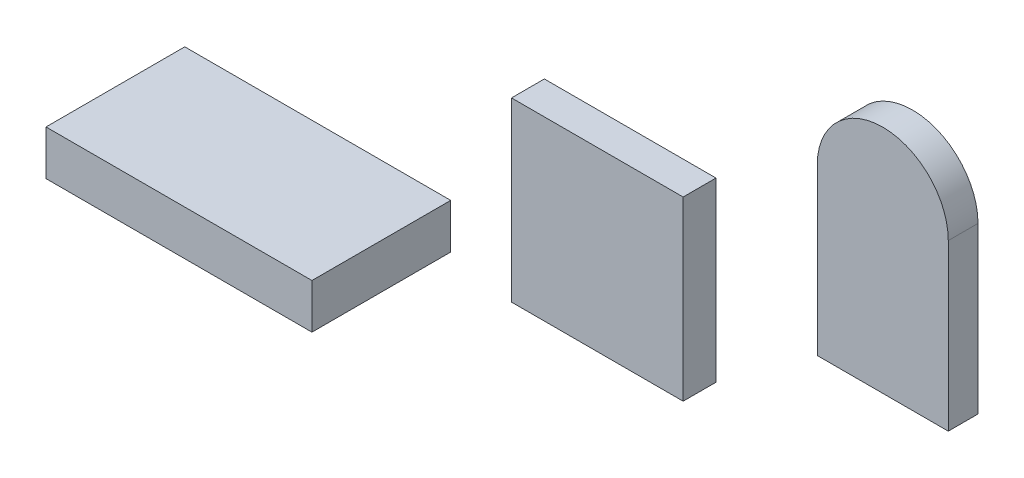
ISO-10303-21;
HEADER;
FILE_DESCRIPTION(('STEP AP214'),'2;1');
FILE_NAME('part.step','',(''),(''),'','','');
FILE_SCHEMA(('AUTOMOTIVE_DESIGN { 1 0 10303 214 1 1 1 1 }'));
ENDSEC;
DATA;
#1=APPLICATION_CONTEXT('core data for automotive mechanical design processes');
#2=APPLICATION_PROTOCOL_DEFINITION('international standard','automotive_design',2000,#1);
#3=PRODUCT_CONTEXT('',#1,'mechanical');
#4=PRODUCT('Part','Part','',(#3));
#5=PRODUCT_RELATED_PRODUCT_CATEGORY('part','',(#4));
#6=PRODUCT_DEFINITION_FORMATION('','',#4);
#7=PRODUCT_DEFINITION_CONTEXT('part definition',#1,'design');
#8=PRODUCT_DEFINITION('design','',#6,#7);
#9=PRODUCT_DEFINITION_SHAPE('','',#8);
#10=(LENGTH_UNIT() NAMED_UNIT(*) SI_UNIT(.MILLI.,.METRE.));
#11=(NAMED_UNIT(*) PLANE_ANGLE_UNIT() SI_UNIT($,.RADIAN.));
#12=(NAMED_UNIT(*) SI_UNIT($,.STERADIAN.) SOLID_ANGLE_UNIT());
#13=UNCERTAINTY_MEASURE_WITH_UNIT(LENGTH_MEASURE(1.E-05),#10,'distance_accuracy_value','');
#14=(GEOMETRIC_REPRESENTATION_CONTEXT(3) GLOBAL_UNCERTAINTY_ASSIGNED_CONTEXT((#13)) GLOBAL_UNIT_ASSIGNED_CONTEXT((#10,
#11,#12)) REPRESENTATION_CONTEXT('',''));
#15=CARTESIAN_POINT('',(0.,0.,0.));
#16=DIRECTION('',(0.,0.,1.));
#17=DIRECTION('',(1.,0.,0.));
#18=AXIS2_PLACEMENT_3D('',#15,#16,#17);
#19=CARTESIAN_POINT('',(48.4335945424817,40.2393912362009,6.63860066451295));
#20=DIRECTION('',(1.,0.,0.));
#21=DIRECTION('',(0.,0.,-1.));
#22=AXIS2_PLACEMENT_3D('',#19,#20,#21);
#23=PLANE('',#22);
#24=DIRECTION('',(0.,-1.,0.));
#25=VECTOR('',#24,1.);
#26=CARTESIAN_POINT('',(48.4335945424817,40.2393912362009,0.));
#27=LINE('',#26,#25);
#28=CARTESIAN_POINT('',(48.4335945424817,40.2393912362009,0.));
#29=VERTEX_POINT('',#28);
#30=CARTESIAN_POINT('',(48.4335945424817,3.3654763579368,0.));
#31=VERTEX_POINT('',#30);
#32=EDGE_CURVE('E106',#29,#31,#27,.T.);
#33=ORIENTED_EDGE('',*,*,#32,.T.);
#34=DIRECTION('',(0.,0.,-1.));
#35=VECTOR('',#34,1.);
#36=CARTESIAN_POINT('',(48.4335945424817,3.3654763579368,6.63860066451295));
#37=LINE('',#36,#35);
#38=CARTESIAN_POINT('',(48.4335945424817,3.3654763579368,6.63860066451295));
#39=VERTEX_POINT('',#38);
#40=EDGE_CURVE('E12',#39,#31,#37,.T.);
#41=ORIENTED_EDGE('',*,*,#40,.F.);
#42=DIRECTION('',(0.,-1.,0.));
#43=VECTOR('',#42,1.);
#44=CARTESIAN_POINT('',(48.4335945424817,40.2393912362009,6.63860066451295));
#45=LINE('',#44,#43);
#46=CARTESIAN_POINT('',(48.4335945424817,40.2393912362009,6.63860066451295));
#47=VERTEX_POINT('',#46);
#48=EDGE_CURVE('E91',#47,#39,#45,.T.);
#49=ORIENTED_EDGE('',*,*,#48,.F.);
#50=DIRECTION('',(0.,0.,-1.));
#51=VECTOR('',#50,1.);
#52=CARTESIAN_POINT('',(48.4335945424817,40.2393912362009,6.63860066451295));
#53=LINE('',#52,#51);
#54=EDGE_CURVE('E102',#47,#29,#53,.T.);
#55=ORIENTED_EDGE('',*,*,#54,.T.);
#56=EDGE_LOOP('',(#33,#41,#49,#55));
#57=FACE_BOUND('',#56,.T.);
#58=ADVANCED_FACE('F44',(#57),#23,.F.);
#59=CARTESIAN_POINT('',(48.4335945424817,3.3654763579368,6.63860066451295));
#60=DIRECTION('',(0.,1.,0.));
#61=DIRECTION('',(0.,0.,1.));
#62=AXIS2_PLACEMENT_3D('',#59,#60,#61);
#63=PLANE('',#62);
#64=DIRECTION('',(1.,0.,0.));
#65=VECTOR('',#64,1.);
#66=CARTESIAN_POINT('',(48.4335945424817,3.3654763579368,0.));
#67=LINE('',#66,#65);
#68=CARTESIAN_POINT('',(77.6986063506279,3.3654763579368,0.));
#69=VERTEX_POINT('',#68);
#70=EDGE_CURVE('E96',#31,#69,#67,.T.);
#71=ORIENTED_EDGE('',*,*,#70,.T.);
#72=DIRECTION('',(0.,0.,-1.));
#73=VECTOR('',#72,1.);
#74=CARTESIAN_POINT('',(77.6986063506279,3.3654763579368,6.63860066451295));
#75=LINE('',#74,#73);
#76=CARTESIAN_POINT('',(77.6986063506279,3.3654763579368,6.63860066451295));
#77=VERTEX_POINT('',#76);
#78=EDGE_CURVE('E52',#77,#69,#75,.T.);
#79=ORIENTED_EDGE('',*,*,#78,.F.);
#80=DIRECTION('',(1.,0.,0.));
#81=VECTOR('',#80,1.);
#82=CARTESIAN_POINT('',(48.4335945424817,3.3654763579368,6.63860066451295));
#83=LINE('',#82,#81);
#84=EDGE_CURVE('E86',#39,#77,#83,.T.);
#85=ORIENTED_EDGE('',*,*,#84,.F.);
#86=ORIENTED_EDGE('',*,*,#40,.T.);
#87=EDGE_LOOP('',(#71,#79,#85,#86));
#88=FACE_BOUND('',#87,.T.);
#89=ADVANCED_FACE('F95',(#88),#63,.F.);
#90=CARTESIAN_POINT('',(77.6986063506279,40.2393912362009,6.63860066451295));
#91=DIRECTION('',(1.,0.,0.));
#92=DIRECTION('',(0.,0.,-1.));
#93=AXIS2_PLACEMENT_3D('',#90,#91,#92);
#94=PLANE('',#93);
#95=DIRECTION('',(0.,-1.,0.));
#96=VECTOR('',#95,1.);
#97=CARTESIAN_POINT('',(77.6986063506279,40.2393912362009,0.));
#98=LINE('',#97,#96);
#99=CARTESIAN_POINT('',(77.6986063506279,40.2393912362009,0.));
#100=VERTEX_POINT('',#99);
#101=EDGE_CURVE('E110',#100,#69,#98,.T.);
#102=ORIENTED_EDGE('',*,*,#101,.F.);
#103=DIRECTION('',(0.,0.,-1.));
#104=VECTOR('',#103,1.);
#105=CARTESIAN_POINT('',(77.6986063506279,40.2393912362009,6.63860066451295));
#106=LINE('',#105,#104);
#107=CARTESIAN_POINT('',(77.6986063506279,40.2393912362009,6.63860066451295));
#108=VERTEX_POINT('',#107);
#109=EDGE_CURVE('E76',#108,#100,#106,.T.);
#110=ORIENTED_EDGE('',*,*,#109,.F.);
#111=DIRECTION('',(0.,-1.,0.));
#112=VECTOR('',#111,1.);
#113=CARTESIAN_POINT('',(77.6986063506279,40.2393912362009,6.63860066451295));
#114=LINE('',#113,#112);
#115=EDGE_CURVE('E89',#108,#77,#114,.T.);
#116=ORIENTED_EDGE('',*,*,#115,.T.);
#117=ORIENTED_EDGE('',*,*,#78,.T.);
#118=EDGE_LOOP('',(#102,#110,#116,#117));
#119=FACE_BOUND('',#118,.T.);
#120=ADVANCED_FACE('F100',(#119),#94,.T.);
#121=CARTESIAN_POINT('',(63.0661004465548,40.2393912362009,6.63860066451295));
#122=DIRECTION('',(0.,0.,-1.));
#123=DIRECTION('',(-1.,0.,0.));
#124=AXIS2_PLACEMENT_3D('',#121,#122,#123);
#125=CYLINDRICAL_SURFACE('',#124,14.6325059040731);
#126=CARTESIAN_POINT('',(63.0661004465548,40.2393912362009,0.));
#127=DIRECTION('',(0.,0.,1.));
#128=DIRECTION('',(1.,0.,0.));
#129=AXIS2_PLACEMENT_3D('',#126,#127,#128);
#130=CIRCLE('',#129,14.6325059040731);
#131=EDGE_CURVE('E79',#100,#29,#130,.T.);
#132=ORIENTED_EDGE('',*,*,#131,.T.);
#133=ORIENTED_EDGE('',*,*,#54,.F.);
#134=CARTESIAN_POINT('',(63.0661004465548,40.2393912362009,6.63860066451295));
#135=DIRECTION('',(0.,0.,1.));
#136=DIRECTION('',(1.,0.,0.));
#137=AXIS2_PLACEMENT_3D('',#134,#135,#136);
#138=CIRCLE('',#137,14.6325059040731);
#139=EDGE_CURVE('E60',#108,#47,#138,.T.);
#140=ORIENTED_EDGE('',*,*,#139,.F.);
#141=ORIENTED_EDGE('',*,*,#109,.T.);
#142=EDGE_LOOP('',(#132,#133,#140,#141));
#143=FACE_BOUND('',#142,.T.);
#144=ADVANCED_FACE('F123',(#143),#125,.T.);
#145=CARTESIAN_POINT('',(63.0661004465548,40.2393912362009,6.63860066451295));
#146=DIRECTION('',(0.,0.,1.));
#147=DIRECTION('',(1.,0.,0.));
#148=AXIS2_PLACEMENT_3D('',#145,#146,#147);
#149=PLANE('',#148);
#150=ORIENTED_EDGE('',*,*,#48,.T.);
#151=ORIENTED_EDGE('',*,*,#84,.T.);
#152=ORIENTED_EDGE('',*,*,#115,.F.);
#153=ORIENTED_EDGE('',*,*,#139,.T.);
#154=EDGE_LOOP('',(#150,#151,#152,#153));
#155=FACE_BOUND('',#154,.T.);
#156=ADVANCED_FACE('F87',(#155),#149,.T.);
#157=CARTESIAN_POINT('',(63.0661004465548,40.2393912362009,0.));
#158=DIRECTION('',(0.,0.,1.));
#159=DIRECTION('',(1.,0.,0.));
#160=AXIS2_PLACEMENT_3D('',#157,#158,#159);
#161=PLANE('',#160);
#162=ORIENTED_EDGE('',*,*,#32,.F.);
#163=ORIENTED_EDGE('',*,*,#131,.F.);
#164=ORIENTED_EDGE('',*,*,#101,.T.);
#165=ORIENTED_EDGE('',*,*,#70,.F.);
#166=EDGE_LOOP('',(#162,#163,#164,#165));
#167=FACE_BOUND('',#166,.T.);
#168=ADVANCED_FACE('F117',(#167),#161,.F.);
#169=CLOSED_SHELL('',(#58,#89,#120,#144,#156,#168));
#170=MANIFOLD_SOLID_BREP('B2',#169);
#171=CARTESIAN_POINT('',(-19.1685827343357,-19.7538829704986,7.33735980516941));
#172=DIRECTION('',(-1.,0.,0.));
#173=DIRECTION('',(0.,0.,1.));
#174=AXIS2_PLACEMENT_3D('',#171,#172,#173);
#175=PLANE('',#174);
#176=DIRECTION('',(0.,1.,0.));
#177=VECTOR('',#176,1.);
#178=CARTESIAN_POINT('',(-19.1685827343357,-19.7538829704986,0.));
#179=LINE('',#178,#177);
#180=CARTESIAN_POINT('',(-19.1685827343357,-19.7538829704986,0.));
#181=VERTEX_POINT('',#180);
#182=CARTESIAN_POINT('',(-19.1685827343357,19.7538829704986,0.));
#183=VERTEX_POINT('',#182);
#184=EDGE_CURVE('E242',#181,#183,#179,.T.);
#185=ORIENTED_EDGE('',*,*,#184,.F.);
#186=DIRECTION('',(0.,0.,-1.));
#187=VECTOR('',#186,1.);
#188=CARTESIAN_POINT('',(-19.1685827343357,-19.7538829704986,7.33735980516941));
#189=LINE('',#188,#187);
#190=CARTESIAN_POINT('',(-19.1685827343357,-19.7538829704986,7.33735980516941));
#191=VERTEX_POINT('',#190);
#192=EDGE_CURVE('E42',#191,#181,#189,.T.);
#193=ORIENTED_EDGE('',*,*,#192,.F.);
#194=DIRECTION('',(0.,1.,0.));
#195=VECTOR('',#194,1.);
#196=CARTESIAN_POINT('',(-19.1685827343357,-19.7538829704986,7.33735980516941));
#197=LINE('',#196,#195);
#198=CARTESIAN_POINT('',(-19.1685827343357,19.7538829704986,7.33735980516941));
#199=VERTEX_POINT('',#198);
#200=EDGE_CURVE('E237',#191,#199,#197,.T.);
#201=ORIENTED_EDGE('',*,*,#200,.T.);
#202=DIRECTION('',(0.,0.,-1.));
#203=VECTOR('',#202,1.);
#204=CARTESIAN_POINT('',(-19.1685827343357,19.7538829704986,7.33735980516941));
#205=LINE('',#204,#203);
#206=EDGE_CURVE('E180',#199,#183,#205,.T.);
#207=ORIENTED_EDGE('',*,*,#206,.T.);
#208=EDGE_LOOP('',(#185,#193,#201,#207));
#209=FACE_BOUND('',#208,.T.);
#210=ADVANCED_FACE('F177',(#209),#175,.T.);
#211=CARTESIAN_POINT('',(-19.1685827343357,-19.7538829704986,7.33735980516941));
#212=DIRECTION('',(0.,1.,0.));
#213=DIRECTION('',(0.,0.,1.));
#214=AXIS2_PLACEMENT_3D('',#211,#212,#213);
#215=PLANE('',#214);
#216=DIRECTION('',(1.,0.,0.));
#217=VECTOR('',#216,1.);
#218=CARTESIAN_POINT('',(-19.1685827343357,-19.7538829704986,0.));
#219=LINE('',#218,#217);
#220=CARTESIAN_POINT('',(19.1685827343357,-19.7538829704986,0.));
#221=VERTEX_POINT('',#220);
#222=EDGE_CURVE('E210',#181,#221,#219,.T.);
#223=ORIENTED_EDGE('',*,*,#222,.T.);
#224=DIRECTION('',(0.,0.,-1.));
#225=VECTOR('',#224,1.);
#226=CARTESIAN_POINT('',(19.1685827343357,-19.7538829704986,7.33735980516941));
#227=LINE('',#226,#225);
#228=CARTESIAN_POINT('',(19.1685827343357,-19.7538829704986,7.33735980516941));
#229=VERTEX_POINT('',#228);
#230=EDGE_CURVE('E186',#229,#221,#227,.T.);
#231=ORIENTED_EDGE('',*,*,#230,.F.);
#232=DIRECTION('',(1.,0.,0.));
#233=VECTOR('',#232,1.);
#234=CARTESIAN_POINT('',(-19.1685827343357,-19.7538829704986,7.33735980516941));
#235=LINE('',#234,#233);
#236=EDGE_CURVE('E227',#191,#229,#235,.T.);
#237=ORIENTED_EDGE('',*,*,#236,.F.);
#238=ORIENTED_EDGE('',*,*,#192,.T.);
#239=EDGE_LOOP('',(#223,#231,#237,#238));
#240=FACE_BOUND('',#239,.T.);
#241=ADVANCED_FACE('F252',(#240),#215,.F.);
#242=CARTESIAN_POINT('',(19.1685827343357,-19.7538829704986,7.33735980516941));
#243=DIRECTION('',(-1.,0.,0.));
#244=DIRECTION('',(0.,0.,1.));
#245=AXIS2_PLACEMENT_3D('',#242,#243,#244);
#246=PLANE('',#245);
#247=DIRECTION('',(0.,1.,0.));
#248=VECTOR('',#247,1.);
#249=CARTESIAN_POINT('',(19.1685827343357,-19.7538829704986,0.));
#250=LINE('',#249,#248);
#251=CARTESIAN_POINT('',(19.1685827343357,19.7538829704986,0.));
#252=VERTEX_POINT('',#251);
#253=EDGE_CURVE('E234',#221,#252,#250,.T.);
#254=ORIENTED_EDGE('',*,*,#253,.T.);
#255=DIRECTION('',(0.,0.,-1.));
#256=VECTOR('',#255,1.);
#257=CARTESIAN_POINT('',(19.1685827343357,19.7538829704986,7.33735980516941));
#258=LINE('',#257,#256);
#259=CARTESIAN_POINT('',(19.1685827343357,19.7538829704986,7.33735980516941));
#260=VERTEX_POINT('',#259);
#261=EDGE_CURVE('E231',#260,#252,#258,.T.);
#262=ORIENTED_EDGE('',*,*,#261,.F.);
#263=DIRECTION('',(0.,1.,0.));
#264=VECTOR('',#263,1.);
#265=CARTESIAN_POINT('',(19.1685827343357,-19.7538829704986,7.33735980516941));
#266=LINE('',#265,#264);
#267=EDGE_CURVE('E222',#229,#260,#266,.T.);
#268=ORIENTED_EDGE('',*,*,#267,.F.);
#269=ORIENTED_EDGE('',*,*,#230,.T.);
#270=EDGE_LOOP('',(#254,#262,#268,#269));
#271=FACE_BOUND('',#270,.T.);
#272=ADVANCED_FACE('F232',(#271),#246,.F.);
#273=CARTESIAN_POINT('',(-19.1685827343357,19.7538829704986,7.33735980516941));
#274=DIRECTION('',(0.,1.,0.));
#275=DIRECTION('',(0.,0.,1.));
#276=AXIS2_PLACEMENT_3D('',#273,#274,#275);
#277=PLANE('',#276);
#278=DIRECTION('',(1.,0.,0.));
#279=VECTOR('',#278,1.);
#280=CARTESIAN_POINT('',(-19.1685827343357,19.7538829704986,0.));
#281=LINE('',#280,#279);
#282=EDGE_CURVE('E245',#183,#252,#281,.T.);
#283=ORIENTED_EDGE('',*,*,#282,.F.);
#284=ORIENTED_EDGE('',*,*,#206,.F.);
#285=DIRECTION('',(1.,0.,0.));
#286=VECTOR('',#285,1.);
#287=CARTESIAN_POINT('',(-19.1685827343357,19.7538829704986,7.33735980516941));
#288=LINE('',#287,#286);
#289=EDGE_CURVE('E226',#199,#260,#288,.T.);
#290=ORIENTED_EDGE('',*,*,#289,.T.);
#291=ORIENTED_EDGE('',*,*,#261,.T.);
#292=EDGE_LOOP('',(#283,#284,#290,#291));
#293=FACE_BOUND('',#292,.T.);
#294=ADVANCED_FACE('F236',(#293),#277,.T.);
#295=CARTESIAN_POINT('',(0.,0.,7.33735980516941));
#296=DIRECTION('',(0.,0.,-1.));
#297=DIRECTION('',(-1.,0.,0.));
#298=AXIS2_PLACEMENT_3D('',#295,#296,#297);
#299=PLANE('',#298);
#300=ORIENTED_EDGE('',*,*,#200,.F.);
#301=ORIENTED_EDGE('',*,*,#236,.T.);
#302=ORIENTED_EDGE('',*,*,#267,.T.);
#303=ORIENTED_EDGE('',*,*,#289,.F.);
#304=EDGE_LOOP('',(#300,#301,#302,#303));
#305=FACE_BOUND('',#304,.T.);
#306=ADVANCED_FACE('F225',(#305),#299,.F.);
#307=CARTESIAN_POINT('',(0.,0.,0.));
#308=DIRECTION('',(0.,0.,-1.));
#309=DIRECTION('',(-1.,0.,0.));
#310=AXIS2_PLACEMENT_3D('',#307,#308,#309);
#311=PLANE('',#310);
#312=ORIENTED_EDGE('',*,*,#184,.T.);
#313=ORIENTED_EDGE('',*,*,#282,.T.);
#314=ORIENTED_EDGE('',*,*,#253,.F.);
#315=ORIENTED_EDGE('',*,*,#222,.F.);
#316=EDGE_LOOP('',(#312,#313,#314,#315));
#317=FACE_BOUND('',#316,.T.);
#318=ADVANCED_FACE('F250',(#317),#311,.T.);
#319=CLOSED_SHELL('',(#210,#241,#272,#294,#306,#318));
#320=MANIFOLD_SOLID_BREP('B6',#319);
#321=CARTESIAN_POINT('',(-99.493429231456,-24.1936039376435,31.));
#322=DIRECTION('',(0.,1.,0.));
#323=DIRECTION('',(0.,0.,1.));
#324=AXIS2_PLACEMENT_3D('',#321,#322,#323);
#325=PLANE('',#324);
#326=DIRECTION('',(1.,0.,0.));
#327=VECTOR('',#326,1.);
#328=CARTESIAN_POINT('',(-99.493429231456,-24.1936039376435,0.));
#329=LINE('',#328,#327);
#330=CARTESIAN_POINT('',(-99.493429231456,-24.1936039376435,0.));
#331=VERTEX_POINT('',#330);
#332=CARTESIAN_POINT('',(-40.0854552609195,-24.1936039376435,0.));
#333=VERTEX_POINT('',#332);
#334=EDGE_CURVE('E364',#331,#333,#329,.T.);
#335=ORIENTED_EDGE('',*,*,#334,.T.);
#336=DIRECTION('',(0.,0.,-1.));
#337=VECTOR('',#336,1.);
#338=CARTESIAN_POINT('',(-40.0854552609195,-24.1936039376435,31.));
#339=LINE('',#338,#337);
#340=CARTESIAN_POINT('',(-40.0854552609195,-24.1936039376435,31.));
#341=VERTEX_POINT('',#340);
#342=EDGE_CURVE('E175',#341,#333,#339,.T.);
#343=ORIENTED_EDGE('',*,*,#342,.F.);
#344=DIRECTION('',(1.,0.,0.));
#345=VECTOR('',#344,1.);
#346=CARTESIAN_POINT('',(-99.493429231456,-24.1936039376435,31.));
#347=LINE('',#346,#345);
#348=CARTESIAN_POINT('',(-99.493429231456,-24.1936039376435,31.));
#349=VERTEX_POINT('',#348);
#350=EDGE_CURVE('E341',#349,#341,#347,.T.);
#351=ORIENTED_EDGE('',*,*,#350,.F.);
#352=DIRECTION('',(0.,0.,-1.));
#353=VECTOR('',#352,1.);
#354=CARTESIAN_POINT('',(-99.493429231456,-24.1936039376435,31.));
#355=LINE('',#354,#353);
#356=EDGE_CURVE('E317',#349,#331,#355,.T.);
#357=ORIENTED_EDGE('',*,*,#356,.T.);
#358=EDGE_LOOP('',(#335,#343,#351,#357));
#359=FACE_BOUND('',#358,.T.);
#360=ADVANCED_FACE('F301',(#359),#325,.F.);
#361=CARTESIAN_POINT('',(-40.0854552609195,-14.1936039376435,31.));
#362=DIRECTION('',(1.,0.,0.));
#363=DIRECTION('',(0.,0.,-1.));
#364=AXIS2_PLACEMENT_3D('',#361,#362,#363);
#365=PLANE('',#364);
#366=DIRECTION('',(0.,-1.,0.));
#367=VECTOR('',#366,1.);
#368=CARTESIAN_POINT('',(-40.0854552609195,-14.1936039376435,0.));
#369=LINE('',#368,#367);
#370=CARTESIAN_POINT('',(-40.0854552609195,-14.1936039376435,0.));
#371=VERTEX_POINT('',#370);
#372=EDGE_CURVE('E350',#371,#333,#369,.T.);
#373=ORIENTED_EDGE('',*,*,#372,.F.);
#374=DIRECTION('',(0.,0.,-1.));
#375=VECTOR('',#374,1.);
#376=CARTESIAN_POINT('',(-40.0854552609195,-14.1936039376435,31.));
#377=LINE('',#376,#375);
#378=CARTESIAN_POINT('',(-40.0854552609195,-14.1936039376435,31.));
#379=VERTEX_POINT('',#378);
#380=EDGE_CURVE('E309',#379,#371,#377,.T.);
#381=ORIENTED_EDGE('',*,*,#380,.F.);
#382=DIRECTION('',(0.,-1.,0.));
#383=VECTOR('',#382,1.);
#384=CARTESIAN_POINT('',(-40.0854552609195,-14.1936039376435,31.));
#385=LINE('',#384,#383);
#386=EDGE_CURVE('E348',#379,#341,#385,.T.);
#387=ORIENTED_EDGE('',*,*,#386,.T.);
#388=ORIENTED_EDGE('',*,*,#342,.T.);
#389=EDGE_LOOP('',(#373,#381,#387,#388));
#390=FACE_BOUND('',#389,.T.);
#391=ADVANCED_FACE('F347',(#390),#365,.T.);
#392=CARTESIAN_POINT('',(-99.493429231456,-14.1936039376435,31.));
#393=DIRECTION('',(0.,1.,0.));
#394=DIRECTION('',(0.,0.,1.));
#395=AXIS2_PLACEMENT_3D('',#392,#393,#394);
#396=PLANE('',#395);
#397=DIRECTION('',(1.,0.,0.));
#398=VECTOR('',#397,1.);
#399=CARTESIAN_POINT('',(-99.493429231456,-14.1936039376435,0.));
#400=LINE('',#399,#398);
#401=CARTESIAN_POINT('',(-99.493429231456,-14.1936039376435,0.));
#402=VERTEX_POINT('',#401);
#403=EDGE_CURVE('E367',#402,#371,#400,.T.);
#404=ORIENTED_EDGE('',*,*,#403,.F.);
#405=DIRECTION('',(0.,0.,-1.));
#406=VECTOR('',#405,1.);
#407=CARTESIAN_POINT('',(-99.493429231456,-14.1936039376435,31.));
#408=LINE('',#407,#406);
#409=CARTESIAN_POINT('',(-99.493429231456,-14.1936039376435,31.));
#410=VERTEX_POINT('',#409);
#411=EDGE_CURVE('E330',#410,#402,#408,.T.);
#412=ORIENTED_EDGE('',*,*,#411,.F.);
#413=DIRECTION('',(1.,0.,0.));
#414=VECTOR('',#413,1.);
#415=CARTESIAN_POINT('',(-99.493429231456,-14.1936039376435,31.));
#416=LINE('',#415,#414);
#417=EDGE_CURVE('E356',#410,#379,#416,.T.);
#418=ORIENTED_EDGE('',*,*,#417,.T.);
#419=ORIENTED_EDGE('',*,*,#380,.T.);
#420=EDGE_LOOP('',(#404,#412,#418,#419));
#421=FACE_BOUND('',#420,.T.);
#422=ADVANCED_FACE('F358',(#421),#396,.T.);
#423=CARTESIAN_POINT('',(-99.493429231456,-24.1936039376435,31.));
#424=DIRECTION('',(-1.,0.,0.));
#425=DIRECTION('',(0.,0.,1.));
#426=AXIS2_PLACEMENT_3D('',#423,#424,#425);
#427=PLANE('',#426);
#428=DIRECTION('',(0.,1.,0.));
#429=VECTOR('',#428,1.);
#430=CARTESIAN_POINT('',(-99.493429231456,-24.1936039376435,0.));
#431=LINE('',#430,#429);
#432=EDGE_CURVE('E369',#331,#402,#431,.T.);
#433=ORIENTED_EDGE('',*,*,#432,.F.);
#434=ORIENTED_EDGE('',*,*,#356,.F.);
#435=DIRECTION('',(0.,1.,0.));
#436=VECTOR('',#435,1.);
#437=CARTESIAN_POINT('',(-99.493429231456,-24.1936039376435,31.));
#438=LINE('',#437,#436);
#439=EDGE_CURVE('E359',#349,#410,#438,.T.);
#440=ORIENTED_EDGE('',*,*,#439,.T.);
#441=ORIENTED_EDGE('',*,*,#411,.T.);
#442=EDGE_LOOP('',(#433,#434,#440,#441));
#443=FACE_BOUND('',#442,.T.);
#444=ADVANCED_FACE('F375',(#443),#427,.T.);
#445=CARTESIAN_POINT('',(0.,-8.97373867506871,31.));
#446=DIRECTION('',(0.,0.,-1.));
#447=DIRECTION('',(-1.,0.,0.));
#448=AXIS2_PLACEMENT_3D('',#445,#446,#447);
#449=PLANE('',#448);
#450=ORIENTED_EDGE('',*,*,#350,.T.);
#451=ORIENTED_EDGE('',*,*,#386,.F.);
#452=ORIENTED_EDGE('',*,*,#417,.F.);
#453=ORIENTED_EDGE('',*,*,#439,.F.);
#454=EDGE_LOOP('',(#450,#451,#452,#453));
#455=FACE_BOUND('',#454,.T.);
#456=ADVANCED_FACE('F355',(#455),#449,.F.);
#457=CARTESIAN_POINT('',(0.,-8.97373867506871,0.));
#458=DIRECTION('',(0.,0.,-1.));
#459=DIRECTION('',(-1.,0.,0.));
#460=AXIS2_PLACEMENT_3D('',#457,#458,#459);
#461=PLANE('',#460);
#462=ORIENTED_EDGE('',*,*,#334,.F.);
#463=ORIENTED_EDGE('',*,*,#432,.T.);
#464=ORIENTED_EDGE('',*,*,#403,.T.);
#465=ORIENTED_EDGE('',*,*,#372,.T.);
#466=EDGE_LOOP('',(#462,#463,#464,#465));
#467=FACE_BOUND('',#466,.T.);
#468=ADVANCED_FACE('F374',(#467),#461,.T.);
#469=CLOSED_SHELL('',(#360,#391,#422,#444,#456,#468));
#470=MANIFOLD_SOLID_BREP('B36',#469);
#471=ADVANCED_BREP_SHAPE_REPRESENTATION('',(#18,#170,#320,#470),#14);
#472=SHAPE_DEFINITION_REPRESENTATION(#9,#471);
ENDSEC;
END-ISO-10303-21;
